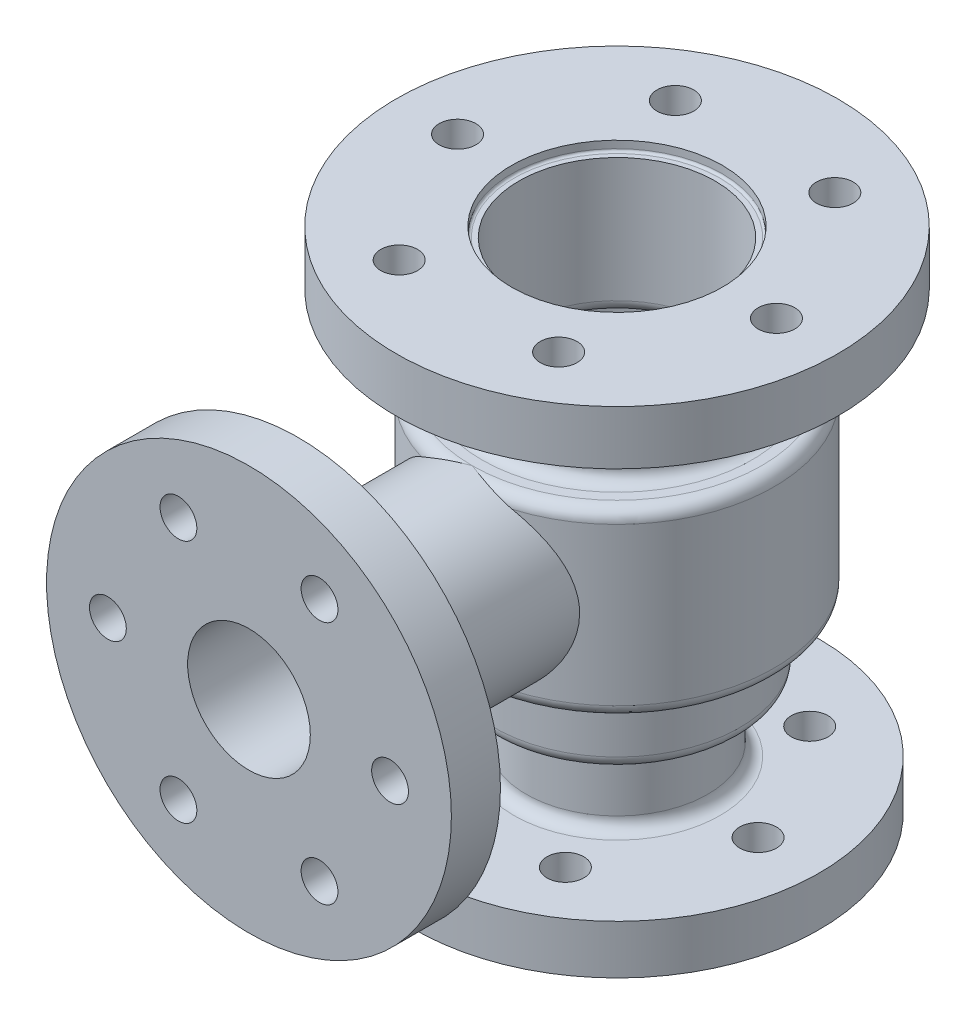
from build123d import *

# Parameters (mm, degrees)
SKETCH3_W          = 117.524834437
SKETCH3_H          = 25
SKETCH4_R          = 7.5
CUT_EXTRUDE1_DEPTH = 22
SKETCH5_R          = 7.5
CUT_EXTRUDE2_DEPTH = 22
CIRPATTERN1_COUNT  = 6
SKETCH6_R          = 7.5
CUT_EXTRUDE3_DEPTH = 22
CIRPATTERN2_COUNT  = 6
FILLET2_R          = 1


with BuildPart() as part:
    # Sketch1 → Base-Revolve (revolve)
    with BuildSketch(Plane.XY, mode=Mode.PRIVATE) as base_revolve_sk:
        with BuildLine():
            Line((25, 0), (82.5, 0))
            Line((82.5, 0), (82.5, 20))
            Line((82.5, 20), (42, 20))
            ThreePointArc((42, 20), (38.464466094, 21.464466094), (37, 25))
            Line((37, 25), (37, 45))
            ThreePointArc((37, 45), (38.464466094, 48.535533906), (42, 50))
            Line((42, 50), (45, 50))
            ThreePointArc((45, 50), (48.535533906, 51.464466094), (50, 55))
            Line((50, 55), (50, 73))
            ThreePointArc((50, 73), (51.464466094, 76.535533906), (55, 78))
            Line((55, 78), (59, 78))
            ThreePointArc((59, 78), (62.535533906, 79.464466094), (64, 83))
            Line((64, 83), (64, 147))
            ThreePointArc((64, 147), (62.535533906, 150.535533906), (59, 152))
            Line((59, 152), (55, 152))
            ThreePointArc((55, 152), (51.464466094, 153.464466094), (50, 157))
            Line((50, 157), (50, 180))
            ThreePointArc((50, 180), (51.464466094, 183.535533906), (55, 185))
            Line((55, 185), (90, 185))
            Line((90, 185), (90, 207))
            Line((90, 207), (69.444453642, 207))
            Line((69.444453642, 207), (43, 207))
            Line((43, 207), (43, 203))
            Line((43, 203), (40, 203))
            Line((40, 203), (40, 152.466520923))
            ThreePointArc((40, 152.466520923), (41.464466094, 148.930987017), (45, 147.466520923))
            Line((45, 147.466520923), (46, 147.466520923))
            Line((46, 147.466520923), (46, 89.919228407))
            Line((46, 89.919228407), (40, 89.919228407))
            Line((40, 89.919228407), (40, 87.919228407))
            Line((40, 87.919228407), (35, 87.919228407))
            Line((35, 87.919228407), (35, 72.919228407))
            Line((35, 72.919228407), (25, 72.919228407))
            Line((25, 72.919228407), (25, 0))
        make_face()
    revolve(base_revolve_sk.sketch.rotate(Axis((0, -30.740728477, 0), (0, 1, 0)), 90), axis=Axis((0, -30.740728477, 0), (0, 1, 0)))

    # Sketch2 → Boss-Revolve1 (revolve)
    with BuildSketch(Plane(origin=(0, 0, 0), x_dir=(0, 0, -1), z_dir=(1, 0, 0)), mode=Mode.PRIVATE) as boss_revolve1_sk:
        Polygon((-57.073839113, 152), (-130, 152), (-130, 197.5), (-150, 197.5), (-150, 140), (-150, 115), (-46, 115), (-46, 140), (-46, 152), align=None)
    revolve(boss_revolve1_sk.sketch.rotate(Axis((0, 115, 226.035840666), (0, 0, -1)), 90), axis=Axis((0, 115, 226.035840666), (0, 0, -1)))

    # Sketch3 → Cut-Revolve1 (revolve, cut)
    with BuildSketch(Plane(origin=(0, 0, 0), x_dir=(0, 0, -1), z_dir=(1, 0, 0)), mode=Mode.PRIVATE) as cut_revolve1_sk:
        with Locations((-91.237582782, 127.5)):
            Rectangle(SKETCH3_W, SKETCH3_H)
    revolve(cut_revolve1_sk.sketch.rotate(Axis((0, 115, 174.511589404), (0, 0, -1)), 90), axis=Axis((0, 115, 174.511589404), (0, 0, -1)), mode=Mode.SUBTRACT)

    # Sketch4 → Cut-Extrude1 (cut)
    with BuildSketch(Plane(origin=(0, 207, 0), x_dir=(-1, 0, 0), z_dir=(0, 1, 0))):
        with Locations(Location((65, 0, 0), (0, 0, 90))):
            Circle(SKETCH4_R)
    cut_extrude1 = extrude(amount=-CUT_EXTRUDE1_DEPTH, mode=Mode.SUBTRACT)

    # Sketch5 → Cut-Extrude2 (cut)
    with BuildSketch(Plane(origin=(93.922550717, 20, -43.958573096), x_dir=(-1, 0, 0), z_dir=(0, 1, 0))):
        with Locations(Location((151.422550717, 43.958573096, 0), (0, 0, 90))):
            Circle(SKETCH5_R)
    cut_extrude2 = extrude(amount=-CUT_EXTRUDE2_DEPTH, mode=Mode.SUBTRACT)

    # CirPattern1: Cut-Extrude1, Cut-Extrude2 ×6 about axis
    cirpattern1_axis = Axis((0, 0, 0), (0, 1, 0))
    add([cut_extrude1.rotate(cirpattern1_axis, i * 360 / CIRPATTERN1_COUNT) for i in range(1, CIRPATTERN1_COUNT)], mode=Mode.SUBTRACT)
    add([cut_extrude2.rotate(cirpattern1_axis, i * 360 / CIRPATTERN1_COUNT) for i in range(1, CIRPATTERN1_COUNT)], mode=Mode.SUBTRACT)

    # Sketch6 → Cut-Extrude3 (cut)
    with BuildSketch(Plane(origin=(-95.61552935, 103.86297869, 150), x_dir=(1, 0, 0), z_dir=(0, 0, 1))):
        with Locations((38.11552935, 11.13702131)):
            Circle(SKETCH6_R)
    cut_extrude3 = extrude(amount=-CUT_EXTRUDE3_DEPTH, mode=Mode.SUBTRACT)

    # CirPattern2: Cut-Extrude3 ×6 about axis
    cirpattern2_axis = Axis((0, 115, 0), (0, 0, 1))
    for i in range(1, CIRPATTERN2_COUNT):
        add(cut_extrude3.rotate(cirpattern2_axis, i * 360 / CIRPATTERN2_COUNT), mode=Mode.SUBTRACT)

    # Fillet2
    fillet2_edges = [part.edges().sort_by_distance(p)[0] for p in [
        (0, 203, 43),
    ]]
    fillet(fillet2_edges, radius=FILLET2_R)


solid = part.part
